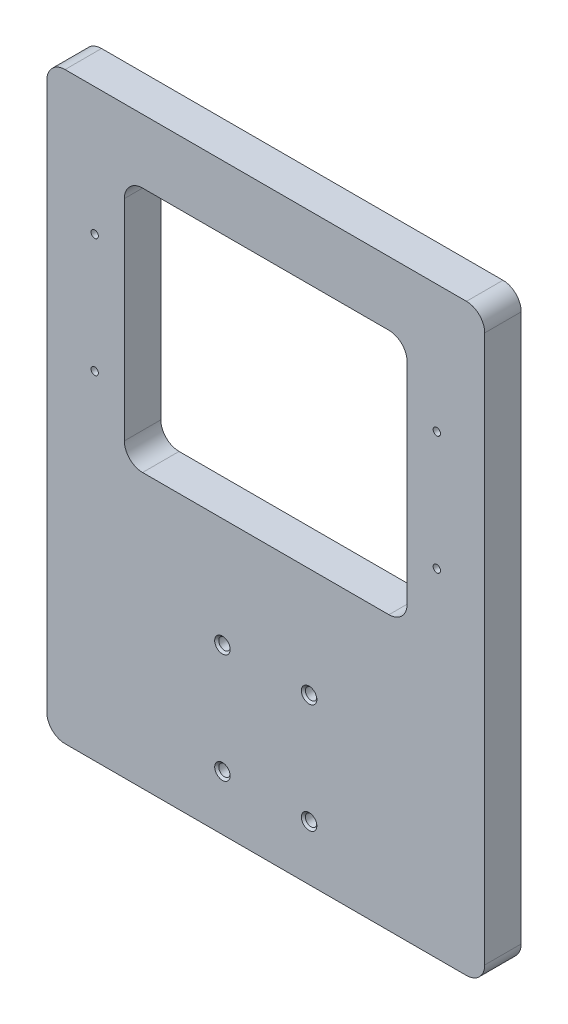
from build123d import *

# Parameters (mm, degrees)
SKETCH1_W                        = 304.8
SKETCH1_H                        = 406.4
BOSS_EXTRUDE1_DEPTH              = 25.4
F_3_8_16_TAPPED_HOLE1_AT_2_COUNT = 2
F_3_8_16_TAPPED_HOLE1_AT_2_PITCH = 76.2
F_3_8_16_TAPPED_HOLE1_AT_3_COUNT = 2
F_3_8_16_TAPPED_HOLE1_AT_3_PITCH = 60.325
F_3_8_16_TAPPED_HOLE1_AT_4_COUNT = 2
F_3_8_16_TAPPED_HOLE1_AT_4_PITCH = 97.188196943
CUT_EXTRUDE1_DEPTH               = 509.63460362
F_1_4_20_TAPPED_HOLE1_D          = 5.1054
FILLET1_R                        = 12.7


with BuildPart() as part:
    # Sketch1 → Boss-Extrude1 (new body)
    with BuildSketch(Plane.XY):
        with Locations((152.4, 203.2)):
            Rectangle(SKETCH1_W, SKETCH1_H)
    extrude(amount=BOSS_EXTRUDE1_DEPTH)

    # Sketch6 → 3_8-16 Tapped Hole1 (revolve, cut)
    with BuildSketch(Plane(origin=(122.2375, 38.1, 25.4), x_dir=(0, -1, 0), z_dir=(1, 0, 0))):
        Polygon((0, 0), (0, 25.4), (5.3975, 25.4), (3.96875, 23.97125), (3.96875, 1.42875), (5.3975, 0), align=None)
    f_3_8_16_tapped_hole1 = revolve(axis=Axis((122.2375, 38.1, 31.75), (0, 0, -1)), mode=Mode.SUBTRACT)

    # 3_8-16 Tapped Hole1 at 2: 3_8-16 Tapped Hole1 ×2
    with Locations(*[(0, i * F_3_8_16_TAPPED_HOLE1_AT_2_PITCH, 0) for i in range(1, F_3_8_16_TAPPED_HOLE1_AT_2_COUNT)]):
        add(f_3_8_16_tapped_hole1, mode=Mode.SUBTRACT)

    # 3_8-16 Tapped Hole1 at 3: 3_8-16 Tapped Hole1 ×2
    with Locations(*[(i * F_3_8_16_TAPPED_HOLE1_AT_3_PITCH, 0, 0) for i in range(1, F_3_8_16_TAPPED_HOLE1_AT_3_COUNT)]):
        add(f_3_8_16_tapped_hole1, mode=Mode.SUBTRACT)

    # 3_8-16 Tapped Hole1 at 4: 3_8-16 Tapped Hole1 ×2
    with Locations(*[Vector(0.6207029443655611, 0.7840458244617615, 0) * (i * F_3_8_16_TAPPED_HOLE1_AT_4_PITCH) for i in range(1, F_3_8_16_TAPPED_HOLE1_AT_4_COUNT)]):
        add(f_3_8_16_tapped_hole1, mode=Mode.SUBTRACT)

    # Sketch7 → Cut-Extrude1 (cut, through all)
    with BuildSketch(Plane.XY.offset(25.4)):
        with BuildLine():
            Line((66.675, 190.5), (238.125, 190.5))
            ThreePointArc((238.125, 190.5), (247.105256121, 194.219743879), (250.825, 203.2))
            Line((250.825, 203.2), (250.825, 349.25))
            ThreePointArc((250.825, 349.25), (247.105256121, 358.230256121), (238.125, 361.95))
            Line((238.125, 361.95), (66.675, 361.95))
            ThreePointArc((66.675, 361.95), (57.694743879, 358.230256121), (53.975, 349.25))
            Line((53.975, 349.25), (53.975, 203.2))
            ThreePointArc((53.975, 203.2), (57.694743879, 194.219743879), (66.675, 190.5))
        make_face()
    extrude(amount=-CUT_EXTRUDE1_DEPTH, mode=Mode.SUBTRACT)

    # 1_4-20 Tapped Hole1 (through all)
    with Locations(Plane.XY.offset(25.4)):
        with Locations((33.3375, 317.5), (271.4625, 317.5), (271.4625, 234.95), (33.3375, 234.95)):
            Hole(F_1_4_20_TAPPED_HOLE1_D / 2)

    # Fillet1
    fillet1_edges = [part.edges().sort_by_distance(p)[0] for p in [
        (0, 0, 12.7),
        (304.8, 0, 12.7),
        (304.8, 406.4, 12.7),
        (0, 406.4, 12.7),
    ]]
    fillet(fillet1_edges, radius=FILLET1_R)


solid = part.part
